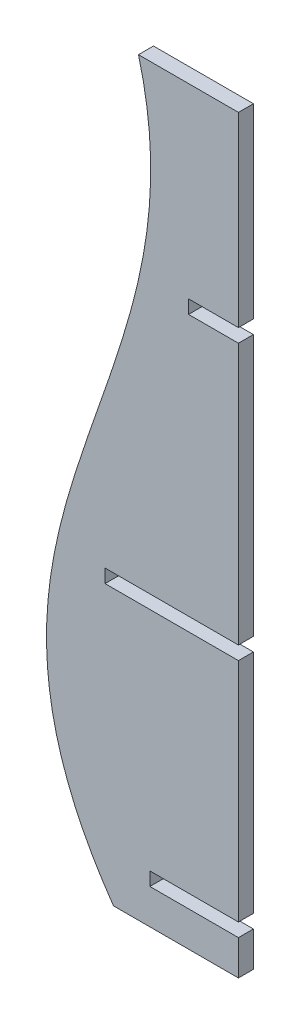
ISO-10303-21;
HEADER;
FILE_DESCRIPTION(('STEP AP214'),'2;1');
FILE_NAME('part.step','',(''),(''),'','','');
FILE_SCHEMA(('AUTOMOTIVE_DESIGN { 1 0 10303 214 1 1 1 1 }'));
ENDSEC;
DATA;
#1=APPLICATION_CONTEXT('core data for automotive mechanical design processes');
#2=APPLICATION_PROTOCOL_DEFINITION('international standard','automotive_design',2000,#1);
#3=PRODUCT_CONTEXT('',#1,'mechanical');
#4=PRODUCT('Part','Part','',(#3));
#5=PRODUCT_RELATED_PRODUCT_CATEGORY('part','',(#4));
#6=PRODUCT_DEFINITION_FORMATION('','',#4);
#7=PRODUCT_DEFINITION_CONTEXT('part definition',#1,'design');
#8=PRODUCT_DEFINITION('design','',#6,#7);
#9=PRODUCT_DEFINITION_SHAPE('','',#8);
#10=(LENGTH_UNIT() NAMED_UNIT(*) SI_UNIT(.MILLI.,.METRE.));
#11=(NAMED_UNIT(*) PLANE_ANGLE_UNIT() SI_UNIT($,.RADIAN.));
#12=(NAMED_UNIT(*) SI_UNIT($,.STERADIAN.) SOLID_ANGLE_UNIT());
#13=UNCERTAINTY_MEASURE_WITH_UNIT(LENGTH_MEASURE(1.E-05),#10,'distance_accuracy_value','');
#14=(GEOMETRIC_REPRESENTATION_CONTEXT(3) GLOBAL_UNCERTAINTY_ASSIGNED_CONTEXT((#13)) GLOBAL_UNIT_ASSIGNED_CONTEXT((#10,
#11,#12)) REPRESENTATION_CONTEXT('',''));
#15=CARTESIAN_POINT('',(0.,0.,0.));
#16=DIRECTION('',(0.,0.,1.));
#17=DIRECTION('',(1.,0.,0.));
#18=AXIS2_PLACEMENT_3D('',#15,#16,#17);
#19=CARTESIAN_POINT('',(-35.,56.2348258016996,3.));
#20=DIRECTION('',(1.,0.,0.));
#21=DIRECTION('',(0.,1.,0.));
#22=AXIS2_PLACEMENT_3D('',#19,#20,#21);
#23=PLANE('',#22);
#24=DIRECTION('',(0.,-1.,0.));
#25=VECTOR('',#24,1.);
#26=CARTESIAN_POINT('',(-35.,56.2348258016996,0.));
#27=LINE('',#26,#25);
#28=CARTESIAN_POINT('',(-35.,56.2348258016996,0.));
#29=VERTEX_POINT('',#28);
#30=CARTESIAN_POINT('',(-35.,3.9348258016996,0.));
#31=VERTEX_POINT('',#30);
#32=EDGE_CURVE('E186',#29,#31,#27,.T.);
#33=ORIENTED_EDGE('',*,*,#32,.F.);
#34=DIRECTION('',(0.,0.,-1.));
#35=VECTOR('',#34,1.);
#36=CARTESIAN_POINT('',(-35.,56.2348258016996,3.));
#37=LINE('',#36,#35);
#38=CARTESIAN_POINT('',(-35.,56.2348258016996,3.));
#39=VERTEX_POINT('',#38);
#40=EDGE_CURVE('E11',#39,#29,#37,.T.);
#41=ORIENTED_EDGE('',*,*,#40,.F.);
#42=DIRECTION('',(0.,-1.,0.));
#43=VECTOR('',#42,1.);
#44=CARTESIAN_POINT('',(-35.,56.2348258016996,3.));
#45=LINE('',#44,#43);
#46=CARTESIAN_POINT('',(-35.,3.9348258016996,3.));
#47=VERTEX_POINT('',#46);
#48=EDGE_CURVE('E232',#39,#47,#45,.T.);
#49=ORIENTED_EDGE('',*,*,#48,.T.);
#50=DIRECTION('',(0.,0.,-1.));
#51=VECTOR('',#50,1.);
#52=CARTESIAN_POINT('',(-35.,3.9348258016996,3.));
#53=LINE('',#52,#51);
#54=EDGE_CURVE('E43',#47,#31,#53,.T.);
#55=ORIENTED_EDGE('',*,*,#54,.T.);
#56=EDGE_LOOP('',(#33,#41,#49,#55));
#57=FACE_BOUND('',#56,.T.);
#58=ADVANCED_FACE('F40',(#57),#23,.T.);
#59=CARTESIAN_POINT('',(-35.,56.2348258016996,3.));
#60=DIRECTION('',(-8.78836169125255E-13,-1.,0.));
#61=DIRECTION('',(1.,-8.78836169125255E-13,0.));
#62=AXIS2_PLACEMENT_3D('',#59,#60,#61);
#63=PLANE('',#62);
#64=DIRECTION('',(-1.,8.78836169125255E-13,0.));
#65=VECTOR('',#64,1.);
#66=CARTESIAN_POINT('',(-35.,56.2348258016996,0.));
#67=LINE('',#66,#65);
#68=CARTESIAN_POINT('',(-44.9799737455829,56.2348258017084,0.));
#69=VERTEX_POINT('',#68);
#70=EDGE_CURVE('E231',#29,#69,#67,.T.);
#71=ORIENTED_EDGE('',*,*,#70,.T.);
#72=DIRECTION('',(0.,0.,-1.));
#73=VECTOR('',#72,1.);
#74=CARTESIAN_POINT('',(-44.9799737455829,56.2348258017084,3.));
#75=LINE('',#74,#73);
#76=CARTESIAN_POINT('',(-44.9799737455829,56.2348258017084,3.));
#77=VERTEX_POINT('',#76);
#78=EDGE_CURVE('E49',#77,#69,#75,.T.);
#79=ORIENTED_EDGE('',*,*,#78,.F.);
#80=DIRECTION('',(-1.,8.78836169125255E-13,0.));
#81=VECTOR('',#80,1.);
#82=CARTESIAN_POINT('',(-35.,56.2348258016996,3.));
#83=LINE('',#82,#81);
#84=EDGE_CURVE('E176',#39,#77,#83,.T.);
#85=ORIENTED_EDGE('',*,*,#84,.F.);
#86=ORIENTED_EDGE('',*,*,#40,.T.);
#87=EDGE_LOOP('',(#71,#79,#85,#86));
#88=FACE_BOUND('',#87,.T.);
#89=ADVANCED_FACE('F262',(#88),#63,.F.);
#90=CARTESIAN_POINT('',(-44.9799737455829,58.9348258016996,3.));
#91=DIRECTION('',(1.,0.,0.));
#92=DIRECTION('',(0.,0.,-1.));
#93=AXIS2_PLACEMENT_3D('',#90,#91,#92);
#94=PLANE('',#93);
#95=DIRECTION('',(0.,-1.,0.));
#96=VECTOR('',#95,1.);
#97=CARTESIAN_POINT('',(-44.9799737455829,58.9348258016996,0.));
#98=LINE('',#97,#96);
#99=CARTESIAN_POINT('',(-44.9799737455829,58.9348258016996,0.));
#100=VERTEX_POINT('',#99);
#101=EDGE_CURVE('E162',#100,#69,#98,.T.);
#102=ORIENTED_EDGE('',*,*,#101,.F.);
#103=DIRECTION('',(0.,0.,-1.));
#104=VECTOR('',#103,1.);
#105=CARTESIAN_POINT('',(-44.9799737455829,58.9348258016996,3.));
#106=LINE('',#105,#104);
#107=CARTESIAN_POINT('',(-44.9799737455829,58.9348258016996,3.));
#108=VERTEX_POINT('',#107);
#109=EDGE_CURVE('E157',#108,#100,#106,.T.);
#110=ORIENTED_EDGE('',*,*,#109,.F.);
#111=DIRECTION('',(0.,-1.,0.));
#112=VECTOR('',#111,1.);
#113=CARTESIAN_POINT('',(-44.9799737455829,58.9348258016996,3.));
#114=LINE('',#113,#112);
#115=EDGE_CURVE('E160',#108,#77,#114,.T.);
#116=ORIENTED_EDGE('',*,*,#115,.T.);
#117=ORIENTED_EDGE('',*,*,#78,.T.);
#118=EDGE_LOOP('',(#102,#110,#116,#117));
#119=FACE_BOUND('',#118,.T.);
#120=ADVANCED_FACE('F159',(#119),#94,.T.);
#121=CARTESIAN_POINT('',(-35.,58.9348258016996,3.));
#122=DIRECTION('',(0.,-1.,0.));
#123=DIRECTION('',(0.,0.,-1.));
#124=AXIS2_PLACEMENT_3D('',#121,#122,#123);
#125=PLANE('',#124);
#126=DIRECTION('',(-1.,0.,0.));
#127=VECTOR('',#126,1.);
#128=CARTESIAN_POINT('',(-35.,58.9348258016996,0.));
#129=LINE('',#128,#127);
#130=CARTESIAN_POINT('',(-35.,58.9348258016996,0.));
#131=VERTEX_POINT('',#130);
#132=EDGE_CURVE('E228',#131,#100,#129,.T.);
#133=ORIENTED_EDGE('',*,*,#132,.F.);
#134=DIRECTION('',(0.,0.,-1.));
#135=VECTOR('',#134,1.);
#136=CARTESIAN_POINT('',(-35.,58.9348258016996,3.));
#137=LINE('',#136,#135);
#138=CARTESIAN_POINT('',(-35.,58.9348258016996,3.));
#139=VERTEX_POINT('',#138);
#140=EDGE_CURVE('E167',#139,#131,#137,.T.);
#141=ORIENTED_EDGE('',*,*,#140,.F.);
#142=DIRECTION('',(-1.,0.,0.));
#143=VECTOR('',#142,1.);
#144=CARTESIAN_POINT('',(-35.,58.9348258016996,3.));
#145=LINE('',#144,#143);
#146=EDGE_CURVE('E174',#139,#108,#145,.T.);
#147=ORIENTED_EDGE('',*,*,#146,.T.);
#148=ORIENTED_EDGE('',*,*,#109,.T.);
#149=EDGE_LOOP('',(#133,#141,#147,#148));
#150=FACE_BOUND('',#149,.T.);
#151=ADVANCED_FACE('F178',(#150),#125,.T.);
#152=CARTESIAN_POINT('',(-35.,96.2348258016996,3.));
#153=DIRECTION('',(1.,0.,0.));
#154=DIRECTION('',(0.,1.,0.));
#155=AXIS2_PLACEMENT_3D('',#152,#153,#154);
#156=PLANE('',#155);
#157=DIRECTION('',(0.,-1.,0.));
#158=VECTOR('',#157,1.);
#159=CARTESIAN_POINT('',(-35.,96.2348258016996,0.));
#160=LINE('',#159,#158);
#161=CARTESIAN_POINT('',(-35.,96.2348258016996,0.));
#162=VERTEX_POINT('',#161);
#163=EDGE_CURVE('E225',#162,#131,#160,.T.);
#164=ORIENTED_EDGE('',*,*,#163,.F.);
#165=DIRECTION('',(0.,0.,-1.));
#166=VECTOR('',#165,1.);
#167=CARTESIAN_POINT('',(-35.,96.2348258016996,3.));
#168=LINE('',#167,#166);
#169=CARTESIAN_POINT('',(-35.,96.2348258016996,3.));
#170=VERTEX_POINT('',#169);
#171=EDGE_CURVE('E236',#170,#162,#168,.T.);
#172=ORIENTED_EDGE('',*,*,#171,.F.);
#173=DIRECTION('',(0.,-1.,0.));
#174=VECTOR('',#173,1.);
#175=CARTESIAN_POINT('',(-35.,96.2348258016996,3.));
#176=LINE('',#175,#174);
#177=EDGE_CURVE('E179',#170,#139,#176,.T.);
#178=ORIENTED_EDGE('',*,*,#177,.T.);
#179=ORIENTED_EDGE('',*,*,#140,.T.);
#180=EDGE_LOOP('',(#164,#172,#178,#179));
#181=FACE_BOUND('',#180,.T.);
#182=ADVANCED_FACE('F352',(#181),#156,.T.);
#183=CARTESIAN_POINT('',(-35.,96.2348258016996,3.));
#184=DIRECTION('',(0.,-1.,0.));
#185=DIRECTION('',(0.,0.,-1.));
#186=AXIS2_PLACEMENT_3D('',#183,#184,#185);
#187=PLANE('',#186);
#188=DIRECTION('',(-1.,0.,0.));
#189=VECTOR('',#188,1.);
#190=CARTESIAN_POINT('',(-35.,96.2348258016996,0.));
#191=LINE('',#190,#189);
#192=CARTESIAN_POINT('',(-55.,96.2348258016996,0.));
#193=VERTEX_POINT('',#192);
#194=EDGE_CURVE('E220',#162,#193,#191,.T.);
#195=ORIENTED_EDGE('',*,*,#194,.T.);
#196=DIRECTION('',(0.,0.,-1.));
#197=VECTOR('',#196,1.);
#198=CARTESIAN_POINT('',(-55.,96.2348258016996,3.));
#199=LINE('',#198,#197);
#200=CARTESIAN_POINT('',(-55.,96.2348258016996,3.));
#201=VERTEX_POINT('',#200);
#202=EDGE_CURVE('E238',#201,#193,#199,.T.);
#203=ORIENTED_EDGE('',*,*,#202,.F.);
#204=DIRECTION('',(-1.,0.,0.));
#205=VECTOR('',#204,1.);
#206=CARTESIAN_POINT('',(-35.,96.2348258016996,3.));
#207=LINE('',#206,#205);
#208=EDGE_CURVE('E181',#170,#201,#207,.T.);
#209=ORIENTED_EDGE('',*,*,#208,.F.);
#210=ORIENTED_EDGE('',*,*,#171,.T.);
#211=EDGE_LOOP('',(#195,#203,#209,#210));
#212=FACE_BOUND('',#211,.T.);
#213=ADVANCED_FACE('F302',(#212),#187,.F.);
#214=CARTESIAN_POINT('',(-55.,96.2348258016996,3.));
#215=CARTESIAN_POINT('',(-40.262794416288,41.2348258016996,3.));
#216=CARTESIAN_POINT('',(-98.5114146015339,1.23482580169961,3.));
#217=CARTESIAN_POINT('',(-60.,-53.7651741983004,3.));
#218=B_SPLINE_CURVE_WITH_KNOTS('',3,(#214,#215,#216,#217),.UNSPECIFIED.,.F.,.F.,(4,4),(0.,1.),.UNSPECIFIED.);
#219=DIRECTION('',(0.,0.,-1.));
#220=VECTOR('',#219,1.);
#221=SURFACE_OF_LINEAR_EXTRUSION('',#218,#220);
#222=CARTESIAN_POINT('',(-55.,96.2348258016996,0.));
#223=CARTESIAN_POINT('',(-40.262794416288,41.2348258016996,0.));
#224=CARTESIAN_POINT('',(-98.5114146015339,1.23482580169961,0.));
#225=CARTESIAN_POINT('',(-60.,-53.7651741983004,0.));
#226=B_SPLINE_CURVE_WITH_KNOTS('',3,(#222,#223,#224,#225),.UNSPECIFIED.,.F.,.F.,(4,4),(0.,1.),.UNSPECIFIED.);
#227=CARTESIAN_POINT('',(-60.,-53.7651741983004,0.));
#228=VERTEX_POINT('',#227);
#229=EDGE_CURVE('E216',#193,#228,#226,.T.);
#230=ORIENTED_EDGE('',*,*,#229,.T.);
#231=DIRECTION('',(0.,0.,-1.));
#232=VECTOR('',#231,1.);
#233=CARTESIAN_POINT('',(-60.,-53.7651741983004,3.));
#234=LINE('',#233,#232);
#235=CARTESIAN_POINT('',(-60.,-53.7651741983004,3.));
#236=VERTEX_POINT('',#235);
#237=EDGE_CURVE('E241',#236,#228,#234,.T.);
#238=ORIENTED_EDGE('',*,*,#237,.F.);
#239=EDGE_CURVE('E289',#201,#236,#218,.T.);
#240=ORIENTED_EDGE('',*,*,#239,.F.);
#241=ORIENTED_EDGE('',*,*,#202,.T.);
#242=EDGE_LOOP('',(#230,#238,#240,#241));
#243=FACE_BOUND('',#242,.T.);
#244=ADVANCED_FACE('F297',(#243),#221,.F.);
#245=CARTESIAN_POINT('',(-60.,-53.7651741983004,3.));
#246=DIRECTION('',(0.,1.,0.));
#247=DIRECTION('',(0.,0.,1.));
#248=AXIS2_PLACEMENT_3D('',#245,#246,#247);
#249=PLANE('',#248);
#250=DIRECTION('',(1.,0.,0.));
#251=VECTOR('',#250,1.);
#252=CARTESIAN_POINT('',(-60.,-53.7651741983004,0.));
#253=LINE('',#252,#251);
#254=CARTESIAN_POINT('',(-35.,-53.7651741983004,0.));
#255=VERTEX_POINT('',#254);
#256=EDGE_CURVE('E213',#228,#255,#253,.T.);
#257=ORIENTED_EDGE('',*,*,#256,.T.);
#258=DIRECTION('',(0.,0.,-1.));
#259=VECTOR('',#258,1.);
#260=CARTESIAN_POINT('',(-35.,-53.7651741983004,3.));
#261=LINE('',#260,#259);
#262=CARTESIAN_POINT('',(-35.,-53.7651741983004,3.));
#263=VERTEX_POINT('',#262);
#264=EDGE_CURVE('E244',#263,#255,#261,.T.);
#265=ORIENTED_EDGE('',*,*,#264,.F.);
#266=DIRECTION('',(1.,0.,0.));
#267=VECTOR('',#266,1.);
#268=CARTESIAN_POINT('',(-60.,-53.7651741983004,3.));
#269=LINE('',#268,#267);
#270=EDGE_CURVE('E287',#236,#263,#269,.T.);
#271=ORIENTED_EDGE('',*,*,#270,.F.);
#272=ORIENTED_EDGE('',*,*,#237,.T.);
#273=EDGE_LOOP('',(#257,#265,#271,#272));
#274=FACE_BOUND('',#273,.T.);
#275=ADVANCED_FACE('F301',(#274),#249,.F.);
#276=CARTESIAN_POINT('',(-35.,-46.7651741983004,3.));
#277=DIRECTION('',(1.,0.,0.));
#278=DIRECTION('',(0.,1.,0.));
#279=AXIS2_PLACEMENT_3D('',#276,#277,#278);
#280=PLANE('',#279);
#281=DIRECTION('',(0.,-1.,0.));
#282=VECTOR('',#281,1.);
#283=CARTESIAN_POINT('',(-35.,-46.7651741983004,0.));
#284=LINE('',#283,#282);
#285=CARTESIAN_POINT('',(-35.,-46.7651741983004,0.));
#286=VERTEX_POINT('',#285);
#287=EDGE_CURVE('E210',#286,#255,#284,.T.);
#288=ORIENTED_EDGE('',*,*,#287,.F.);
#289=DIRECTION('',(0.,0.,-1.));
#290=VECTOR('',#289,1.);
#291=CARTESIAN_POINT('',(-35.,-46.7651741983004,3.));
#292=LINE('',#291,#290);
#293=CARTESIAN_POINT('',(-35.,-46.7651741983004,3.));
#294=VERTEX_POINT('',#293);
#295=EDGE_CURVE('E246',#294,#286,#292,.T.);
#296=ORIENTED_EDGE('',*,*,#295,.F.);
#297=DIRECTION('',(0.,-1.,0.));
#298=VECTOR('',#297,1.);
#299=CARTESIAN_POINT('',(-35.,-46.7651741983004,3.));
#300=LINE('',#299,#298);
#301=EDGE_CURVE('E284',#294,#263,#300,.T.);
#302=ORIENTED_EDGE('',*,*,#301,.T.);
#303=ORIENTED_EDGE('',*,*,#264,.T.);
#304=EDGE_LOOP('',(#288,#296,#302,#303));
#305=FACE_BOUND('',#304,.T.);
#306=ADVANCED_FACE('F307',(#305),#280,.T.);
#307=CARTESIAN_POINT('',(-52.7179022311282,-46.7651741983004,3.));
#308=DIRECTION('',(0.,1.,0.));
#309=DIRECTION('',(0.,0.,1.));
#310=AXIS2_PLACEMENT_3D('',#307,#308,#309);
#311=PLANE('',#310);
#312=DIRECTION('',(1.,0.,0.));
#313=VECTOR('',#312,1.);
#314=CARTESIAN_POINT('',(-52.7179022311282,-46.7651741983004,0.));
#315=LINE('',#314,#313);
#316=CARTESIAN_POINT('',(-52.7179022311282,-46.7651741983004,0.));
#317=VERTEX_POINT('',#316);
#318=EDGE_CURVE('E207',#317,#286,#315,.T.);
#319=ORIENTED_EDGE('',*,*,#318,.F.);
#320=DIRECTION('',(0.,0.,-1.));
#321=VECTOR('',#320,1.);
#322=CARTESIAN_POINT('',(-52.7179022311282,-46.7651741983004,3.));
#323=LINE('',#322,#321);
#324=CARTESIAN_POINT('',(-52.7179022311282,-46.7651741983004,3.));
#325=VERTEX_POINT('',#324);
#326=EDGE_CURVE('E248',#325,#317,#323,.T.);
#327=ORIENTED_EDGE('',*,*,#326,.F.);
#328=DIRECTION('',(1.,0.,0.));
#329=VECTOR('',#328,1.);
#330=CARTESIAN_POINT('',(-52.7179022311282,-46.7651741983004,3.));
#331=LINE('',#330,#329);
#332=EDGE_CURVE('E281',#325,#294,#331,.T.);
#333=ORIENTED_EDGE('',*,*,#332,.T.);
#334=ORIENTED_EDGE('',*,*,#295,.T.);
#335=EDGE_LOOP('',(#319,#327,#333,#334));
#336=FACE_BOUND('',#335,.T.);
#337=ADVANCED_FACE('F311',(#336),#311,.T.);
#338=CARTESIAN_POINT('',(-52.7179022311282,-44.0651741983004,3.));
#339=DIRECTION('',(1.,0.,0.));
#340=DIRECTION('',(0.,0.,-1.));
#341=AXIS2_PLACEMENT_3D('',#338,#339,#340);
#342=PLANE('',#341);
#343=DIRECTION('',(0.,-1.,0.));
#344=VECTOR('',#343,1.);
#345=CARTESIAN_POINT('',(-52.7179022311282,-44.0651741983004,0.));
#346=LINE('',#345,#344);
#347=CARTESIAN_POINT('',(-52.7179022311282,-44.0651741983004,0.));
#348=VERTEX_POINT('',#347);
#349=EDGE_CURVE('E204',#348,#317,#346,.T.);
#350=ORIENTED_EDGE('',*,*,#349,.F.);
#351=DIRECTION('',(0.,0.,-1.));
#352=VECTOR('',#351,1.);
#353=CARTESIAN_POINT('',(-52.7179022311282,-44.0651741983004,3.));
#354=LINE('',#353,#352);
#355=CARTESIAN_POINT('',(-52.7179022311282,-44.0651741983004,3.));
#356=VERTEX_POINT('',#355);
#357=EDGE_CURVE('E250',#356,#348,#354,.T.);
#358=ORIENTED_EDGE('',*,*,#357,.F.);
#359=DIRECTION('',(0.,-1.,0.));
#360=VECTOR('',#359,1.);
#361=CARTESIAN_POINT('',(-52.7179022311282,-44.0651741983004,3.));
#362=LINE('',#361,#360);
#363=EDGE_CURVE('E278',#356,#325,#362,.T.);
#364=ORIENTED_EDGE('',*,*,#363,.T.);
#365=ORIENTED_EDGE('',*,*,#326,.T.);
#366=EDGE_LOOP('',(#350,#358,#364,#365));
#367=FACE_BOUND('',#366,.T.);
#368=ADVANCED_FACE('F315',(#367),#342,.T.);
#369=CARTESIAN_POINT('',(-52.7179022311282,-44.0651741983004,3.));
#370=DIRECTION('',(0.,1.,0.));
#371=DIRECTION('',(0.,0.,1.));
#372=AXIS2_PLACEMENT_3D('',#369,#370,#371);
#373=PLANE('',#372);
#374=DIRECTION('',(1.,0.,0.));
#375=VECTOR('',#374,1.);
#376=CARTESIAN_POINT('',(-52.7179022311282,-44.0651741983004,0.));
#377=LINE('',#376,#375);
#378=CARTESIAN_POINT('',(-35.,-44.0651741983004,0.));
#379=VERTEX_POINT('',#378);
#380=EDGE_CURVE('E201',#348,#379,#377,.T.);
#381=ORIENTED_EDGE('',*,*,#380,.T.);
#382=DIRECTION('',(0.,0.,-1.));
#383=VECTOR('',#382,1.);
#384=CARTESIAN_POINT('',(-35.,-44.0651741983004,3.));
#385=LINE('',#384,#383);
#386=CARTESIAN_POINT('',(-35.,-44.0651741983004,3.));
#387=VERTEX_POINT('',#386);
#388=EDGE_CURVE('E252',#387,#379,#385,.T.);
#389=ORIENTED_EDGE('',*,*,#388,.F.);
#390=DIRECTION('',(1.,0.,0.));
#391=VECTOR('',#390,1.);
#392=CARTESIAN_POINT('',(-52.7179022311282,-44.0651741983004,3.));
#393=LINE('',#392,#391);
#394=EDGE_CURVE('E276',#356,#387,#393,.T.);
#395=ORIENTED_EDGE('',*,*,#394,.F.);
#396=ORIENTED_EDGE('',*,*,#357,.T.);
#397=EDGE_LOOP('',(#381,#389,#395,#396));
#398=FACE_BOUND('',#397,.T.);
#399=ADVANCED_FACE('F319',(#398),#373,.F.);
#400=CARTESIAN_POINT('',(-35.,1.23482580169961,3.));
#401=DIRECTION('',(1.,0.,0.));
#402=DIRECTION('',(0.,1.,0.));
#403=AXIS2_PLACEMENT_3D('',#400,#401,#402);
#404=PLANE('',#403);
#405=DIRECTION('',(0.,-1.,0.));
#406=VECTOR('',#405,1.);
#407=CARTESIAN_POINT('',(-35.,1.23482580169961,0.));
#408=LINE('',#407,#406);
#409=CARTESIAN_POINT('',(-35.,1.23482580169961,0.));
#410=VERTEX_POINT('',#409);
#411=EDGE_CURVE('E198',#410,#379,#408,.T.);
#412=ORIENTED_EDGE('',*,*,#411,.F.);
#413=DIRECTION('',(0.,0.,-1.));
#414=VECTOR('',#413,1.);
#415=CARTESIAN_POINT('',(-35.,1.23482580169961,3.));
#416=LINE('',#415,#414);
#417=CARTESIAN_POINT('',(-35.,1.23482580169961,3.));
#418=VERTEX_POINT('',#417);
#419=EDGE_CURVE('E254',#418,#410,#416,.T.);
#420=ORIENTED_EDGE('',*,*,#419,.F.);
#421=DIRECTION('',(0.,-1.,0.));
#422=VECTOR('',#421,1.);
#423=CARTESIAN_POINT('',(-35.,1.23482580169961,3.));
#424=LINE('',#423,#422);
#425=EDGE_CURVE('E273',#418,#387,#424,.T.);
#426=ORIENTED_EDGE('',*,*,#425,.T.);
#427=ORIENTED_EDGE('',*,*,#388,.T.);
#428=EDGE_LOOP('',(#412,#420,#426,#427));
#429=FACE_BOUND('',#428,.T.);
#430=ADVANCED_FACE('F323',(#429),#404,.T.);
#431=CARTESIAN_POINT('',(-35.,1.23482580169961,3.));
#432=DIRECTION('',(0.,-1.,0.));
#433=DIRECTION('',(1.,0.,0.));
#434=AXIS2_PLACEMENT_3D('',#431,#432,#433);
#435=PLANE('',#434);
#436=DIRECTION('',(-1.,0.,0.));
#437=VECTOR('',#436,1.);
#438=CARTESIAN_POINT('',(-35.,1.23482580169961,0.));
#439=LINE('',#438,#437);
#440=CARTESIAN_POINT('',(-61.6852279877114,1.23482580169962,0.));
#441=VERTEX_POINT('',#440);
#442=EDGE_CURVE('E195',#410,#441,#439,.T.);
#443=ORIENTED_EDGE('',*,*,#442,.T.);
#444=DIRECTION('',(0.,0.,-1.));
#445=VECTOR('',#444,1.);
#446=CARTESIAN_POINT('',(-61.6852279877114,1.23482580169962,3.));
#447=LINE('',#446,#445);
#448=CARTESIAN_POINT('',(-61.6852279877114,1.23482580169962,3.));
#449=VERTEX_POINT('',#448);
#450=EDGE_CURVE('E256',#449,#441,#447,.T.);
#451=ORIENTED_EDGE('',*,*,#450,.F.);
#452=DIRECTION('',(-1.,0.,0.));
#453=VECTOR('',#452,1.);
#454=CARTESIAN_POINT('',(-35.,1.23482580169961,3.));
#455=LINE('',#454,#453);
#456=EDGE_CURVE('E271',#418,#449,#455,.T.);
#457=ORIENTED_EDGE('',*,*,#456,.F.);
#458=ORIENTED_EDGE('',*,*,#419,.T.);
#459=EDGE_LOOP('',(#443,#451,#457,#458));
#460=FACE_BOUND('',#459,.T.);
#461=ADVANCED_FACE('F327',(#460),#435,.F.);
#462=CARTESIAN_POINT('',(-61.6852279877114,3.9348258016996,3.));
#463=DIRECTION('',(1.,0.,0.));
#464=DIRECTION('',(0.,0.,-1.));
#465=AXIS2_PLACEMENT_3D('',#462,#463,#464);
#466=PLANE('',#465);
#467=DIRECTION('',(0.,-1.,0.));
#468=VECTOR('',#467,1.);
#469=CARTESIAN_POINT('',(-61.6852279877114,3.9348258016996,0.));
#470=LINE('',#469,#468);
#471=CARTESIAN_POINT('',(-61.6852279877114,3.9348258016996,0.));
#472=VERTEX_POINT('',#471);
#473=EDGE_CURVE('E192',#472,#441,#470,.T.);
#474=ORIENTED_EDGE('',*,*,#473,.F.);
#475=DIRECTION('',(0.,0.,-1.));
#476=VECTOR('',#475,1.);
#477=CARTESIAN_POINT('',(-61.6852279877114,3.9348258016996,3.));
#478=LINE('',#477,#476);
#479=CARTESIAN_POINT('',(-61.6852279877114,3.9348258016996,3.));
#480=VERTEX_POINT('',#479);
#481=EDGE_CURVE('E257',#480,#472,#478,.T.);
#482=ORIENTED_EDGE('',*,*,#481,.F.);
#483=DIRECTION('',(0.,-1.,0.));
#484=VECTOR('',#483,1.);
#485=CARTESIAN_POINT('',(-61.6852279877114,3.9348258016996,3.));
#486=LINE('',#485,#484);
#487=EDGE_CURVE('E266',#480,#449,#486,.T.);
#488=ORIENTED_EDGE('',*,*,#487,.T.);
#489=ORIENTED_EDGE('',*,*,#450,.T.);
#490=EDGE_LOOP('',(#474,#482,#488,#489));
#491=FACE_BOUND('',#490,.T.);
#492=ADVANCED_FACE('F331',(#491),#466,.T.);
#493=CARTESIAN_POINT('',(-35.,3.9348258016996,3.));
#494=DIRECTION('',(0.,-1.,0.));
#495=DIRECTION('',(1.,0.,0.));
#496=AXIS2_PLACEMENT_3D('',#493,#494,#495);
#497=PLANE('',#496);
#498=DIRECTION('',(-1.,0.,0.));
#499=VECTOR('',#498,1.);
#500=CARTESIAN_POINT('',(-35.,3.9348258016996,0.));
#501=LINE('',#500,#499);
#502=EDGE_CURVE('E189',#31,#472,#501,.T.);
#503=ORIENTED_EDGE('',*,*,#502,.F.);
#504=ORIENTED_EDGE('',*,*,#54,.F.);
#505=DIRECTION('',(-1.,0.,0.));
#506=VECTOR('',#505,1.);
#507=CARTESIAN_POINT('',(-35.,3.9348258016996,3.));
#508=LINE('',#507,#506);
#509=EDGE_CURVE('E264',#47,#480,#508,.T.);
#510=ORIENTED_EDGE('',*,*,#509,.T.);
#511=ORIENTED_EDGE('',*,*,#481,.T.);
#512=EDGE_LOOP('',(#503,#504,#510,#511));
#513=FACE_BOUND('',#512,.T.);
#514=ADVANCED_FACE('F259',(#513),#497,.T.);
#515=CARTESIAN_POINT('',(-66.4153283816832,21.2348258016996,3.));
#516=DIRECTION('',(0.,0.,1.));
#517=DIRECTION('',(1.,0.,0.));
#518=AXIS2_PLACEMENT_3D('',#515,#516,#517);
#519=PLANE('',#518);
#520=ORIENTED_EDGE('',*,*,#48,.F.);
#521=ORIENTED_EDGE('',*,*,#84,.T.);
#522=ORIENTED_EDGE('',*,*,#115,.F.);
#523=ORIENTED_EDGE('',*,*,#146,.F.);
#524=ORIENTED_EDGE('',*,*,#177,.F.);
#525=ORIENTED_EDGE('',*,*,#208,.T.);
#526=ORIENTED_EDGE('',*,*,#239,.T.);
#527=ORIENTED_EDGE('',*,*,#270,.T.);
#528=ORIENTED_EDGE('',*,*,#301,.F.);
#529=ORIENTED_EDGE('',*,*,#332,.F.);
#530=ORIENTED_EDGE('',*,*,#363,.F.);
#531=ORIENTED_EDGE('',*,*,#394,.T.);
#532=ORIENTED_EDGE('',*,*,#425,.F.);
#533=ORIENTED_EDGE('',*,*,#456,.T.);
#534=ORIENTED_EDGE('',*,*,#487,.F.);
#535=ORIENTED_EDGE('',*,*,#509,.F.);
#536=EDGE_LOOP('',(#520,#521,#522,#523,#524,#525,#526,#527,#528,#529,#530,#531,#532,#533,#534,#535));
#537=FACE_BOUND('',#536,.T.);
#538=ADVANCED_FACE('F172',(#537),#519,.T.);
#539=CARTESIAN_POINT('',(-66.4153283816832,21.2348258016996,0.));
#540=DIRECTION('',(0.,0.,1.));
#541=DIRECTION('',(1.,0.,0.));
#542=AXIS2_PLACEMENT_3D('',#539,#540,#541);
#543=PLANE('',#542);
#544=ORIENTED_EDGE('',*,*,#32,.T.);
#545=ORIENTED_EDGE('',*,*,#502,.T.);
#546=ORIENTED_EDGE('',*,*,#473,.T.);
#547=ORIENTED_EDGE('',*,*,#442,.F.);
#548=ORIENTED_EDGE('',*,*,#411,.T.);
#549=ORIENTED_EDGE('',*,*,#380,.F.);
#550=ORIENTED_EDGE('',*,*,#349,.T.);
#551=ORIENTED_EDGE('',*,*,#318,.T.);
#552=ORIENTED_EDGE('',*,*,#287,.T.);
#553=ORIENTED_EDGE('',*,*,#256,.F.);
#554=ORIENTED_EDGE('',*,*,#229,.F.);
#555=ORIENTED_EDGE('',*,*,#194,.F.);
#556=ORIENTED_EDGE('',*,*,#163,.T.);
#557=ORIENTED_EDGE('',*,*,#132,.T.);
#558=ORIENTED_EDGE('',*,*,#101,.T.);
#559=ORIENTED_EDGE('',*,*,#70,.F.);
#560=EDGE_LOOP('',(#544,#545,#546,#547,#548,#549,#550,#551,#552,#553,#554,#555,#556,#557,#558,#559));
#561=FACE_BOUND('',#560,.T.);
#562=ADVANCED_FACE('F261',(#561),#543,.F.);
#563=CLOSED_SHELL('',(#58,#89,#120,#151,#182,#213,#244,#275,#306,#337,#368,#399,#430,#461,#492,
#514,#538,#562));
#564=MANIFOLD_SOLID_BREP('B2',#563);
#565=ADVANCED_BREP_SHAPE_REPRESENTATION('',(#18,#564),#14);
#566=SHAPE_DEFINITION_REPRESENTATION(#9,#565);
ENDSEC;
END-ISO-10303-21;
